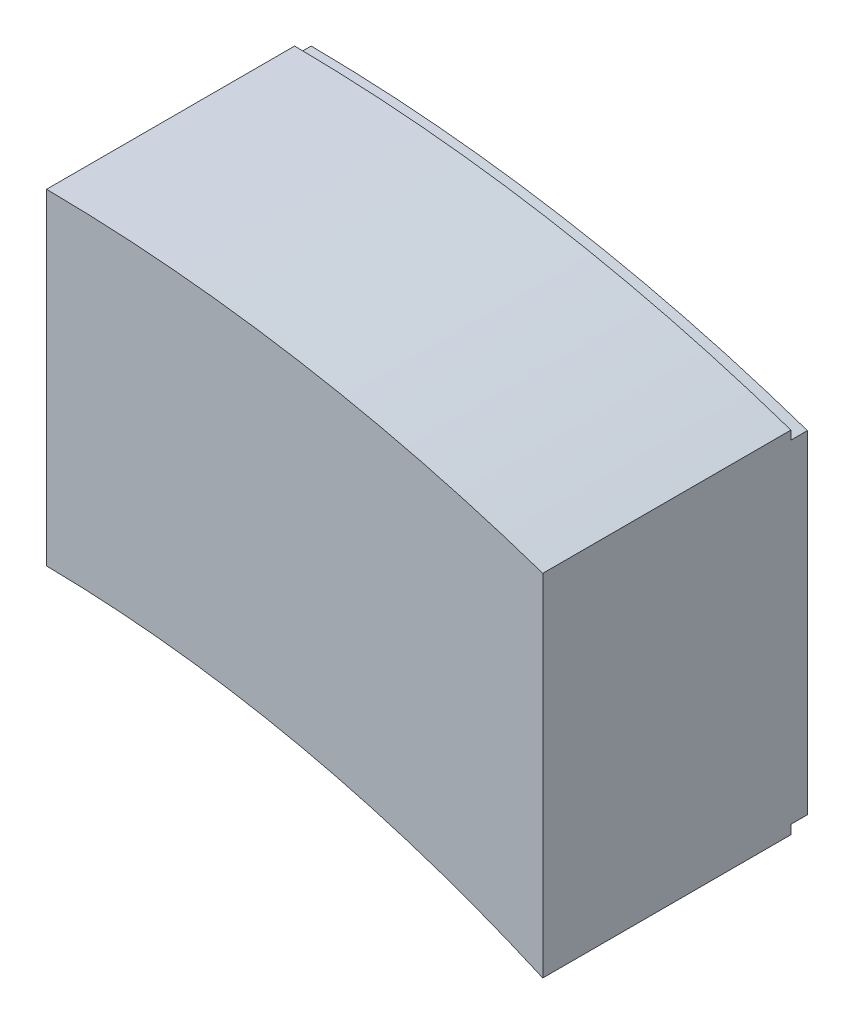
from build123d import *

# Parameters (mm, degrees)
SKETCH2_W      = 15
SKETCH2_H      = 8
EXTRUDE1_DEPTH = 7.307
EXTRUDE3_DEPTH = 8
EXTRUDE4_DEPTH = 8
EXTRUDE5_DEPTH = 0.5


with BuildPart() as part:
    # Sketch2 → Extrude1 (new body)
    with BuildSketch(Plane(origin=(0, 0, 0), x_dir=(1, 0, 0), z_dir=(0, 1, 0))):
        with Locations((0, 4)):
            Rectangle(SKETCH2_W, SKETCH2_H)
    extrude(amount=EXTRUDE1_DEPTH)

    # Sketch3 → Extrude3 (add)
    with BuildSketch(Plane(origin=(0, -0.693, -8), x_dir=(1, 0, 0), z_dir=(0, 0, 1))):
        with BuildLine():
            Line((7.5, 0.693), (7.5, -2.59349747))
            ThreePointArc((7.5, -2.59349747), (0.167110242, -0.187535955), (-7.5, 0.693))
            Line((-7.5, 0.693), (7.5, 0.693))
        make_face()
    extrude(amount=EXTRUDE3_DEPTH)

    # Sketch4 → Extrude4 (add)
    with BuildSketch(Plane(origin=(0, 0, -8), x_dir=(-1, 0, 0), z_dir=(0, 0, -1))):
        with BuildLine():
            Line((-7.5, 7.307), (7.5, 7.307))
            Line((7.5, 7.307), (7.5, 9.861))
            ThreePointArc((7.5, 9.861), (-0.101845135, 9.182150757), (-7.5, 7.307))
        make_face()
    extrude(amount=-EXTRUDE4_DEPTH)

    # Sketch5 → Extrude5 (cut)
    with BuildSketch(Plane(origin=(0, 0, -8), x_dir=(-1, 0, 0), z_dir=(0, 0, -1))):
        with BuildLine():
            Line((7.5, 9.861), (7.5, 9.610988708))
            ThreePointArc((7.5, 9.610988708), (-0.102968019, 8.928341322), (-7.5, 7.042857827))
            Line((-7.5, 7.042857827), (-7.5, 7.307))
            ThreePointArc((-7.5, 7.307), (-0.101845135, 9.182150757), (7.5, 9.861))
        make_face()
        with BuildLine():
            Line((7.5, 0), (7.5, 0.250020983))
            ThreePointArc((7.5, 0.250020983), (-0.164762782, -0.624134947), (-7.5, -3.013074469))
            Line((-7.5, -3.013074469), (-7.5, -3.28649747))
            ThreePointArc((-7.5, -3.28649747), (-0.167110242, -0.880535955), (7.5, 0))
        make_face()
    extrude(amount=-EXTRUDE5_DEPTH, mode=Mode.SUBTRACT)


solid = part.part
